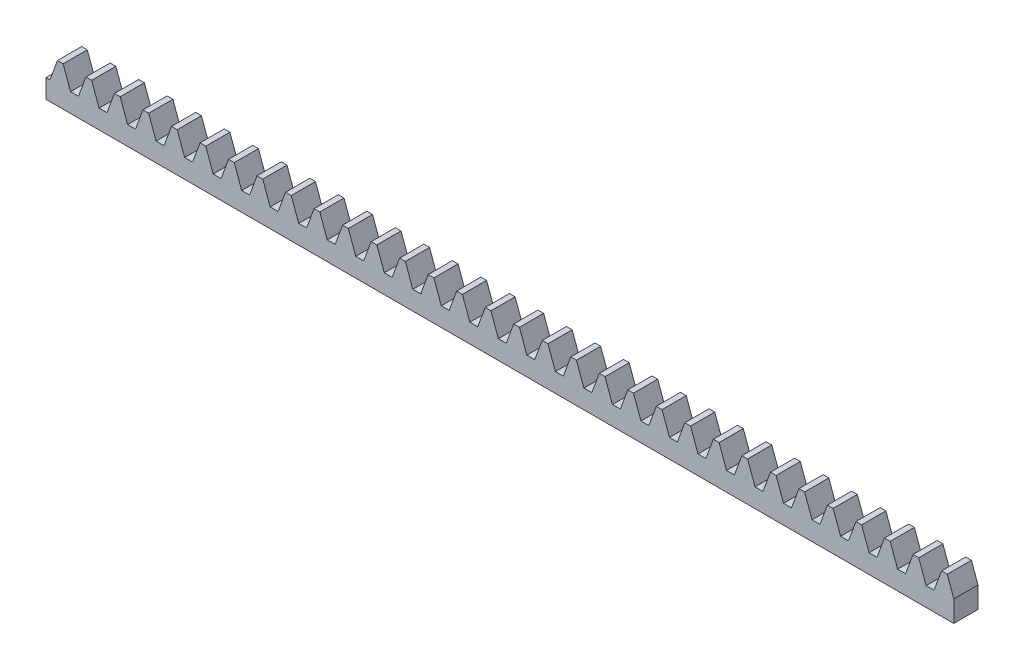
from build123d import *

# Parameters (mm, degrees)
BLANKSKE_W        = 150
BLANKSKE_H        = 6.5
BLANK_DEPTH       = 4
TOOTHCUTSIM_DEPTH = 151.19404116
TEETHCUTS_COUNT   = 33
TEETHCUTS_PITCH   = 4.712388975


with BuildPart() as part:
    # BlankSke → Blank (new body)
    with BuildSketch(Plane.XY):
        with Locations((75, 3.25)):
            Rectangle(BLANKSKE_W, BLANKSKE_H)
    extrude(amount=-BLANK_DEPTH)

    # TooCutSkeSim → ToothCutSim (cut, through all)
    with BuildSketch(Plane.XY):
        Polygon((0.654653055, 3.125), (-0.654653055, 3.125), (-1.892297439, 6.5254), (1.892297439, 6.5254), align=None)
    toothcutsim = extrude(amount=-TOOTHCUTSIM_DEPTH, mode=Mode.SUBTRACT)

    # TeethCuts: ToothCutSim ×33
    with Locations(*[(i * TEETHCUTS_PITCH, 0, 0) for i in range(1, TEETHCUTS_COUNT)]):
        add(toothcutsim, mode=Mode.SUBTRACT)


solid = part.part
